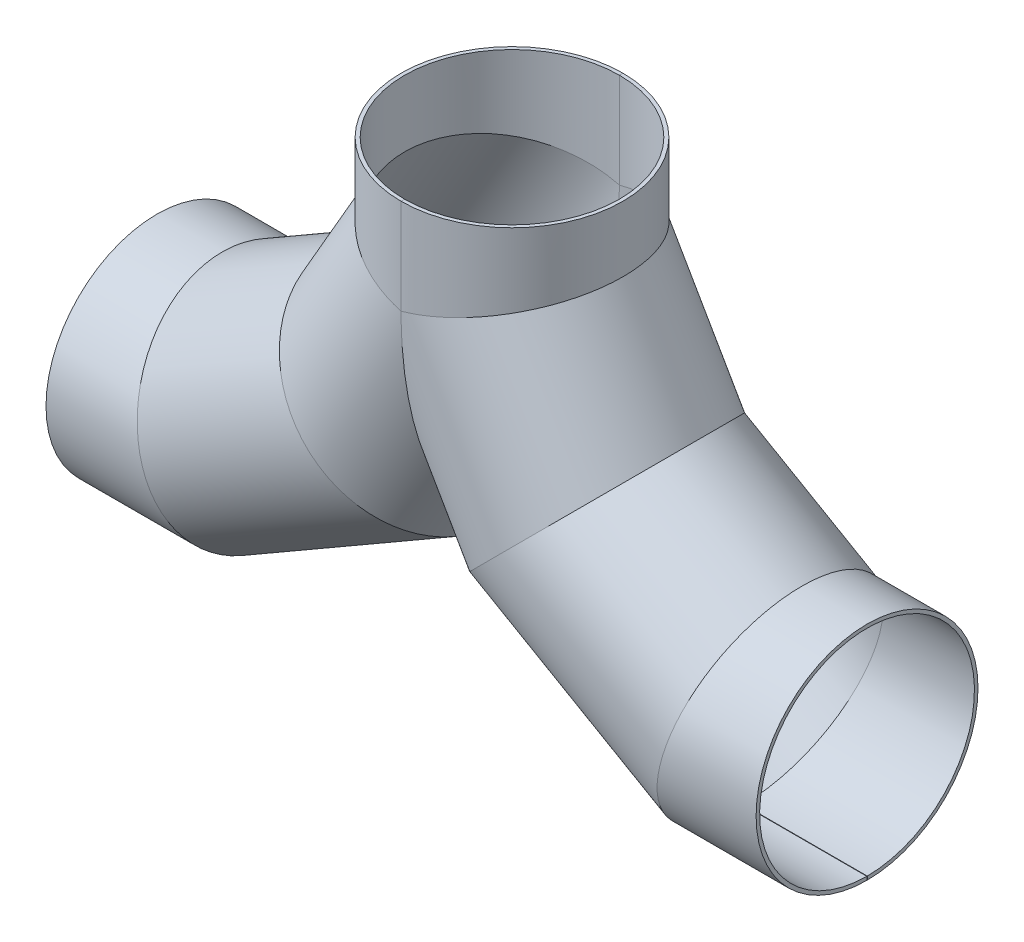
from build123d import *

# Parameters (mm, degrees)
SKETCH_2_R                 = 250
SKETCH_2_R_2               = 242
EXTRUDE_1_DEPTH            = 281.346652
EXTRUDE_2_DEPTH            = 281.346652
EXTRUDE_2_DEPTH_BACK       = 281.346652
SKETCH_3_R                 = 250
SKETCH_3_R_2               = 242
EXTRUDE_3_DEPTH            = 281.346652
EXTRUDE_3_DEPTH_BACK       = 281.346652
SKETCH_4_R                 = 250
SKETCH_4_R_2               = 242
SKETCH_5_R                 = 250
SKETCH_5_R_2               = 242
EXTRUDE_4_DEPTH            = 281.346652
CUT_EXTRUDE_1_DEPTH        = 1344.502884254
CUT_EXTRUDE_1_DEPTH_BACK   = 1344.502884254
CUT_EXTRUDE_2_DEPTH        = 1344.502884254
CUT_EXTRUDE_2_DEPTH_BACK   = 1344.502884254
CUT_EXTRUDE_3_DEPTH        = 1344.502884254
CUT_EXTRUDE_3_DEPTH_BACK   = 1344.502884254
CUT_EXTRUDE_4_DEPTH        = 1344.502884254
CUT_EXTRUDE_4_DEPTH_BACK   = 1344.502884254
CUT_EXTRUDE_5_DEPTH        = 1344.502884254
CUT_EXTRUDE_5_DEPTH_BACK   = 1344.502884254
CUT_EXTRUDE_6_DEPTH        = 1344.502884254
CUT_EXTRUDE_6_DEPTH_BACK   = 1344.502884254
CUT_EXTRUDE_1_2_DEPTH      = 958.882383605
CUT_EXTRUDE_1_2_DEPTH_BACK = 958.882383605
SKETCH_9_W                 = 250
SKETCH_9_H                 = 1
CUT_EXTRUDE_2_2_DEPTH      = 1132.3879356
CUT_EXTRUDE_2_2_DEPTH_BACK = 1132.3879356
SKETCH_10_W                = 1
SKETCH_10_H                = 250
SKETCH_11_W                = 1
SKETCH_11_H                = 250
CUT_EXTRUDE_4_2_DEPTH      = 1506.822034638
CUT_EXTRUDE_8_DEPTH        = 1344.502493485
CUT_EXTRUDE_8_DEPTH_BACK   = 1344.502493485


with BuildPart() as part:
    # Sketch 2 → Extrude 1 (new body)
    with BuildSketch(Plane(origin=(0, 0, 0), x_dir=(1, 0, 0), z_dir=(0, 1, 0))):
        Circle(SKETCH_2_R)
        Circle(SKETCH_2_R_2, mode=Mode.SUBTRACT)
    extrude(amount=-EXTRUDE_1_DEPTH)

    # Sketch 6 → Cut-Extrude 1 (cut, two sides: drawn at the far end of the back side and taken through both)
    with BuildSketch(Plane.XY.offset(-CUT_EXTRUDE_1_DEPTH_BACK)):
        Polygon((3678.31260621, 771.241538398), (800, 0), (-250, -281.346652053), (-3128.31260621, -1052.588190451), (-1585.829529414, -6809.213402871), (5220.795683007, -4985.383674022), align=None)
    extrude(amount=CUT_EXTRUDE_1_DEPTH + CUT_EXTRUDE_1_DEPTH_BACK, mode=Mode.SUBTRACT)


with BuildPart() as body_2:
    # Sketch 3 → Extrude 2 (new, two sides: drawn at the far end of the back side and taken through both)
    with BuildSketch(Plane(origin=(200, -346.410161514, 0), x_dir=(0.8660254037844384, 0.5000000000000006, 0), z_dir=(0.5000000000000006, -0.8660254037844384, 0)).offset(-EXTRUDE_2_DEPTH_BACK)):
        with Locations((-107.179676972, 0)):
            Circle(SKETCH_3_R)
        with Locations((-107.179676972, 0)):
            Circle(SKETCH_3_R_2, mode=Mode.SUBTRACT)
    extrude(amount=EXTRUDE_2_DEPTH + EXTRUDE_2_DEPTH_BACK)

    # Sketch 6_2 → Cut-Extrude 2 (cut, two sides: drawn at the far end of the back side and taken through both)
    with BuildSketch(Plane.XY.offset(-CUT_EXTRUDE_2_DEPTH_BACK)):
        Polygon((3678.31260621, 771.241538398), (800, 0), (-250, -281.346652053), (-3128.31260621, -1052.588190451), (-4670.795683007, 4704.037021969), (2135.829529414, 6527.866750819), align=None)
    extrude(amount=CUT_EXTRUDE_2_DEPTH + CUT_EXTRUDE_2_DEPTH_BACK, mode=Mode.SUBTRACT)

    # Sketch 7 → Cut-Extrude 3 (cut, two sides: drawn at the far end of the back side and taken through both)
    with BuildSketch(Plane.XY.offset(-CUT_EXTRUDE_3_DEPTH_BACK)):
        Polygon((2907.071067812, 2107.071067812), (800, 0), (31.346652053, -768.653347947), (-2075.724415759, -2875.724415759), (2138.417719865, -7089.866551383), (7121.213203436, -2107.071067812), align=None)
    extrude(amount=CUT_EXTRUDE_3_DEPTH + CUT_EXTRUDE_3_DEPTH_BACK, mode=Mode.SUBTRACT)

    # Sketch 9 → Cut-Extrude 1 2 (cut, two sides: drawn at the far end of the back side and taken through both)
    with BuildSketch(Plane(origin=(200, -346.410161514, 0), x_dir=(0.8660254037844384, 0.5000000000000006, 0), z_dir=(0.5000000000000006, -0.8660254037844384, 0)).offset(-CUT_EXTRUDE_1_2_DEPTH_BACK)):
        with Locations((-232.179676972, 0)):
            Rectangle(SKETCH_9_W, SKETCH_9_H)
    extrude(amount=CUT_EXTRUDE_1_2_DEPTH + CUT_EXTRUDE_1_2_DEPTH_BACK, mode=Mode.SUBTRACT)


with BuildPart() as body_3:
    # Sketch 4 → Extrude 3 (new, two sides: drawn at the far end of the back side and taken through both)
    with BuildSketch(Plane(origin=(600, -346.410161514, 0), x_dir=(0, 0, -1), z_dir=(0.8660254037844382, -0.500000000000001, 0)).offset(-EXTRUDE_3_DEPTH_BACK)):
        with Locations((0, -400)):
            Circle(SKETCH_4_R)
        with Locations((0, -400)):
            Circle(SKETCH_4_R_2, mode=Mode.SUBTRACT)
    extrude(amount=EXTRUDE_3_DEPTH + EXTRUDE_3_DEPTH_BACK)

    # Sketch 7_2 → Cut-Extrude 4 (cut, two sides: drawn at the far end of the back side and taken through both)
    with BuildSketch(Plane.XY.offset(-CUT_EXTRUDE_4_DEPTH_BACK)):
        Polygon((2907.071067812, 2107.071067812), (800, 0), (31.346652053, -768.653347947), (-2075.724415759, -2875.724415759), (-6289.866551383, 1338.417719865), (-1307.071067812, 6321.213203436), align=None)
    extrude(amount=CUT_EXTRUDE_4_DEPTH + CUT_EXTRUDE_4_DEPTH_BACK, mode=Mode.SUBTRACT)

    # Sketch 8 → Cut-Extrude 5 (cut, two sides: drawn at the far end of the back side and taken through both)
    with BuildSketch(Plane.XY.offset(-CUT_EXTRUDE_5_DEPTH_BACK)):
        Polygon((1571.241538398, 2878.31260621), (800, 0), (518.653347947, -1050), (-252.588190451, -3928.31260621), (5504.037021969, -5470.795683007), (7327.866750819, 1335.829529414), align=None)
    extrude(amount=CUT_EXTRUDE_5_DEPTH + CUT_EXTRUDE_5_DEPTH_BACK, mode=Mode.SUBTRACT)

    # Sketch 10 → Cut-Extrude 2 2 (cut, two sides: drawn at the far end of the back side and taken through both)
    with BuildSketch(Plane(origin=(600, -346.410161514, 0), x_dir=(0, 0, -1), z_dir=(0.8660254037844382, -0.500000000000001, 0)).offset(-CUT_EXTRUDE_2_2_DEPTH_BACK)):
        with Locations((0, -525)):
            Rectangle(SKETCH_10_W, SKETCH_10_H)
    extrude(amount=CUT_EXTRUDE_2_2_DEPTH + CUT_EXTRUDE_2_2_DEPTH_BACK, mode=Mode.SUBTRACT)


with BuildPart() as body_4:
    # Sketch 5 → Extrude 4 (new body)
    with BuildSketch(Plane(origin=(800, 0, 0), x_dir=(0, 0, -1), z_dir=(1, 0, 0))):
        with Locations((0, -800)):
            Circle(SKETCH_5_R)
        with Locations((0, -800)):
            Circle(SKETCH_5_R_2, mode=Mode.SUBTRACT)
    extrude(amount=-EXTRUDE_4_DEPTH)

    # Sketch 8_2 → Cut-Extrude 6 (cut, two sides: drawn at the far end of the back side and taken through both)
    with BuildSketch(Plane.XY.offset(-CUT_EXTRUDE_6_DEPTH_BACK)):
        Polygon((1571.241538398, 2878.31260621), (800, 0), (518.653347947, -1050), (-252.588190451, -3928.31260621), (-6009.213402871, -2385.829529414), (-4185.383674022, 4420.795683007), align=None)
    extrude(amount=CUT_EXTRUDE_6_DEPTH + CUT_EXTRUDE_6_DEPTH_BACK, mode=Mode.SUBTRACT)

    # Sketch 11 → Cut-Extrude 4 2 (cut, through all)
    with BuildSketch(Plane(origin=(800, 0, 0), x_dir=(0, 0, -1), z_dir=(1, 0, 0))):
        with Locations((0, -925)):
            Rectangle(SKETCH_11_W, SKETCH_11_H)
    extrude(amount=-CUT_EXTRUDE_4_2_DEPTH, mode=Mode.SUBTRACT)


with BuildPart() as cut_extrude_8_tool:
    # Sketch 1 → Cut-Extrude 8 (new, two sides: drawn at the far end of the back side and taken through both)
    with BuildSketch(Plane.XY.offset(-CUT_EXTRUDE_8_DEPTH_BACK)):
        Polygon((0, -3700.075756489), (0, -1050), (0, 0), (0, 2650.075756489), (-5300.151512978, 2650.075756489), (-5300.151512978, -3700.075756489), align=None)
    extrude(amount=CUT_EXTRUDE_8_DEPTH + CUT_EXTRUDE_8_DEPTH_BACK)


with BuildPart() as part_1:
    add(part.part)

    # Cut-Extrude 8: cut by cut_extrude_8_tool
    add(cut_extrude_8_tool.part, mode=Mode.SUBTRACT)


with BuildPart() as body_2_1:
    add(body_2.part)

    # Cut-Extrude 8: cut by cut_extrude_8_tool
    add(cut_extrude_8_tool.part, mode=Mode.SUBTRACT)


with BuildPart() as body_5:
    # Mirror 1: mirrored copy
    add(body_4.part.mirror(Plane(origin=(0, 0, 0), x_dir=(0, 0, 1), z_dir=(1, 0, 0))))


with BuildPart() as body_6:
    # Mirror 1 2: mirrored copy
    add(body_3.part.mirror(Plane(origin=(0, 0, 0), x_dir=(0, 0, 1), z_dir=(1, 0, 0))))


with BuildPart() as body_7:
    # Mirror 1 3: mirrored copy
    add(body_2_1.part.mirror(Plane(origin=(0, 0, 0), x_dir=(0, 0, 1), z_dir=(1, 0, 0))))


with BuildPart() as body_8:
    # Mirror 1 4: mirrored copy
    add(part_1.part.mirror(Plane(origin=(0, 0, 0), x_dir=(0, 0, 1), z_dir=(1, 0, 0))))


solid = Compound([body_3.part, body_4.part, part_1.part, body_2_1.part, body_5.part, body_6.part, body_7.part, body_8.part])
